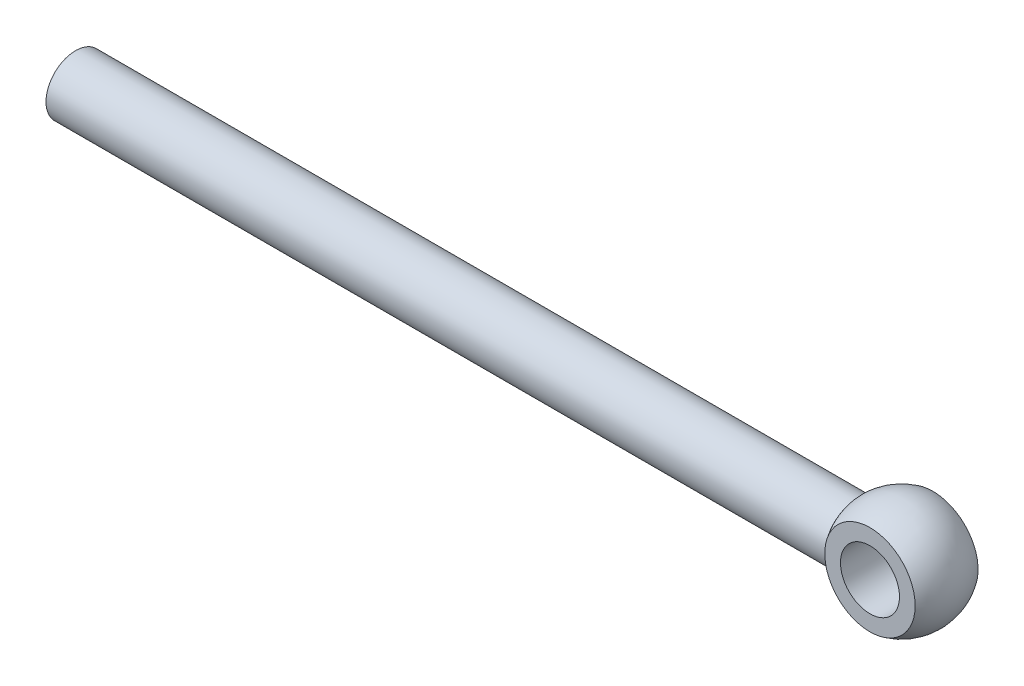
ISO-10303-21;
HEADER;
FILE_DESCRIPTION(('STEP AP214'),'2;1');
FILE_NAME('part.step','',(''),(''),'','','');
FILE_SCHEMA(('AUTOMOTIVE_DESIGN { 1 0 10303 214 1 1 1 1 }'));
ENDSEC;
DATA;
#1=APPLICATION_CONTEXT('core data for automotive mechanical design processes');
#2=APPLICATION_PROTOCOL_DEFINITION('international standard','automotive_design',2000,#1);
#3=PRODUCT_CONTEXT('',#1,'mechanical');
#4=PRODUCT('Part','Part','',(#3));
#5=PRODUCT_RELATED_PRODUCT_CATEGORY('part','',(#4));
#6=PRODUCT_DEFINITION_FORMATION('','',#4);
#7=PRODUCT_DEFINITION_CONTEXT('part definition',#1,'design');
#8=PRODUCT_DEFINITION('design','',#6,#7);
#9=PRODUCT_DEFINITION_SHAPE('','',#8);
#10=(LENGTH_UNIT() NAMED_UNIT(*) SI_UNIT(.MILLI.,.METRE.));
#11=(NAMED_UNIT(*) PLANE_ANGLE_UNIT() SI_UNIT($,.RADIAN.));
#12=(NAMED_UNIT(*) SI_UNIT($,.STERADIAN.) SOLID_ANGLE_UNIT());
#13=UNCERTAINTY_MEASURE_WITH_UNIT(LENGTH_MEASURE(1.E-05),#10,'distance_accuracy_value','');
#14=(GEOMETRIC_REPRESENTATION_CONTEXT(3) GLOBAL_UNCERTAINTY_ASSIGNED_CONTEXT((#13)) GLOBAL_UNIT_ASSIGNED_CONTEXT((#10,
#11,#12)) REPRESENTATION_CONTEXT('',''));
#15=CARTESIAN_POINT('',(0.,0.,0.));
#16=DIRECTION('',(0.,0.,1.));
#17=DIRECTION('',(1.,0.,0.));
#18=AXIS2_PLACEMENT_3D('',#15,#16,#17);
#19=CARTESIAN_POINT('',(1050.,0.,0.));
#20=DIRECTION('',(-1.,0.,0.));
#21=DIRECTION('',(0.,1.,0.));
#22=AXIS2_PLACEMENT_3D('',#19,#20,#21);
#23=SPHERICAL_SURFACE('',#22,70.0000000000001);
#24=CARTESIAN_POINT('',(1050.,0.,-40.));
#25=DIRECTION('',(0.,0.,-1.));
#26=DIRECTION('',(-1.,0.,0.));
#27=AXIS2_PLACEMENT_3D('',#24,#25,#26);
#28=CIRCLE('',#27,57.4456264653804);
#29=CARTESIAN_POINT('',(992.55437353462,0.,-40.));
#30=VERTEX_POINT('',#29);
#31=EDGE_CURVE('E36',#30,#30,#28,.T.);
#32=ORIENTED_EDGE('',*,*,#31,.F.);
#33=EDGE_LOOP('',(#32));
#34=FACE_BOUND('',#33,.T.);
#35=CARTESIAN_POINT('',(990.892047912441,0.,0.));
#36=DIRECTION('',(1.,0.,0.));
#37=DIRECTION('',(0.,0.,-1.));
#38=AXIS2_PLACEMENT_3D('',#35,#36,#37);
#39=CIRCLE('',#38,37.5);
#40=CARTESIAN_POINT('',(990.892047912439,0.,37.5));
#41=VERTEX_POINT('',#40);
#42=EDGE_CURVE('E74',#41,#41,#39,.F.);
#43=ORIENTED_EDGE('',*,*,#42,.F.);
#44=EDGE_LOOP('',(#43));
#45=FACE_BOUND('',#44,.T.);
#46=CARTESIAN_POINT('',(1120.,0.,0.));
#47=VERTEX_POINT('',#46);
#48=VERTEX_LOOP('',#47);
#49=FACE_BOUND('',#48,.T.);
#50=CARTESIAN_POINT('',(1050.,0.,40.));
#51=DIRECTION('',(0.,0.,1.));
#52=DIRECTION('',(1.,0.,0.));
#53=AXIS2_PLACEMENT_3D('',#50,#51,#52);
#54=CIRCLE('',#53,57.4456264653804);
#55=CARTESIAN_POINT('',(1107.44562646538,0.,40.));
#56=VERTEX_POINT('',#55);
#57=EDGE_CURVE('E11',#56,#56,#54,.T.);
#58=ORIENTED_EDGE('',*,*,#57,.F.);
#59=EDGE_LOOP('',(#58));
#60=FACE_BOUND('',#59,.T.);
#61=ADVANCED_FACE('F30',(#34,#45,#49,#60),#23,.T.);
#62=CARTESIAN_POINT('',(500000.,0.,0.));
#63=DIRECTION('',(-1.,0.,0.));
#64=DIRECTION('',(0.,0.,1.));
#65=AXIS2_PLACEMENT_3D('',#62,#63,#64);
#66=CYLINDRICAL_SURFACE('',#65,37.5);
#67=CARTESIAN_POINT('',(0.,0.,0.));
#68=DIRECTION('',(1.,0.,0.));
#69=DIRECTION('',(0.,0.,-1.));
#70=AXIS2_PLACEMENT_3D('',#67,#68,#69);
#71=CIRCLE('',#70,37.5);
#72=CARTESIAN_POINT('',(0.,0.,37.5));
#73=VERTEX_POINT('',#72);
#74=EDGE_CURVE('E71',#73,#73,#71,.T.);
#75=CARTESIAN_POINT('',(0.,0.,37.5));
#76=CARTESIAN_POINT('',(10.3217921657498,0.,37.5));
#77=CARTESIAN_POINT('',(20.6435843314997,0.,37.5));
#78=CARTESIAN_POINT('',(41.2871686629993,0.,37.5));
#79=CARTESIAN_POINT('',(51.6089608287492,0.,37.5));
#80=CARTESIAN_POINT('',(72.2525451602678,0.,37.5));
#81=CARTESIAN_POINT('',(82.5743373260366,0.,37.5));
#82=CARTESIAN_POINT('',(103.217921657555,0.,37.5));
#83=CARTESIAN_POINT('',(113.539713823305,0.,37.5));
#84=CARTESIAN_POINT('',(134.183298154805,0.,37.5));
#85=CARTESIAN_POINT('',(144.505090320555,0.,37.5));
#86=CARTESIAN_POINT('',(165.148674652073,0.,37.5));
#87=CARTESIAN_POINT('',(175.470466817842,0.,37.5));
#88=CARTESIAN_POINT('',(196.114051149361,0.,37.5));
#89=CARTESIAN_POINT('',(206.43584331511,0.,37.5));
#90=CARTESIAN_POINT('',(227.07942764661,0.,37.5));
#91=CARTESIAN_POINT('',(237.40121981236,0.,37.5));
#92=CARTESIAN_POINT('',(258.04480414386,0.,37.5));
#93=CARTESIAN_POINT('',(268.366596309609,0.,37.5));
#94=CARTESIAN_POINT('',(289.010180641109,0.,37.5));
#95=CARTESIAN_POINT('',(299.331972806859,0.,37.5));
#96=CARTESIAN_POINT('',(319.975557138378,0.,37.5));
#97=CARTESIAN_POINT('',(330.297349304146,0.,37.5));
#98=CARTESIAN_POINT('',(350.940933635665,0.,37.5));
#99=CARTESIAN_POINT('',(361.262725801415,0.,37.5));
#100=CARTESIAN_POINT('',(381.906310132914,0.,37.5));
#101=CARTESIAN_POINT('',(392.228102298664,0.,37.5));
#102=CARTESIAN_POINT('',(412.871686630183,0.,37.5));
#103=CARTESIAN_POINT('',(423.193478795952,0.,37.5));
#104=CARTESIAN_POINT('',(443.83706312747,0.,37.5));
#105=CARTESIAN_POINT('',(454.15885529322,0.,37.5));
#106=CARTESIAN_POINT('',(474.80243962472,0.,37.5));
#107=CARTESIAN_POINT('',(485.12423179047,0.,37.5));
#108=CARTESIAN_POINT('',(505.767816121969,0.,37.5));
#109=CARTESIAN_POINT('',(516.089608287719,0.,37.5));
#110=CARTESIAN_POINT('',(536.733192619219,0.,37.5));
#111=CARTESIAN_POINT('',(547.054984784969,0.,37.5));
#112=CARTESIAN_POINT('',(567.698569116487,0.,37.5));
#113=CARTESIAN_POINT('',(578.020361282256,0.,37.5));
#114=CARTESIAN_POINT('',(598.663945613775,0.,37.5));
#115=CARTESIAN_POINT('',(608.985737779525,0.,37.5));
#116=CARTESIAN_POINT('',(629.629322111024,0.,37.5));
#117=CARTESIAN_POINT('',(639.951114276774,0.,37.5));
#118=CARTESIAN_POINT('',(660.594698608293,0.,37.5));
#119=CARTESIAN_POINT('',(670.916490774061,0.,37.5));
#120=CARTESIAN_POINT('',(691.56007510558,0.,37.5));
#121=CARTESIAN_POINT('',(701.88186727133,0.,37.5));
#122=CARTESIAN_POINT('',(722.52545160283,0.,37.5));
#123=CARTESIAN_POINT('',(732.847243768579,0.,37.5));
#124=CARTESIAN_POINT('',(753.490828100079,0.,37.5));
#125=CARTESIAN_POINT('',(763.812620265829,0.,37.5));
#126=CARTESIAN_POINT('',(784.456204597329,0.,37.5));
#127=CARTESIAN_POINT('',(794.777996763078,0.,37.5));
#128=CARTESIAN_POINT('',(815.421581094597,0.,37.5));
#129=CARTESIAN_POINT('',(825.743373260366,0.,37.5));
#130=CARTESIAN_POINT('',(846.386957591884,0.,37.5));
#131=CARTESIAN_POINT('',(856.708749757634,0.,37.5));
#132=CARTESIAN_POINT('',(877.352334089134,0.,37.5));
#133=CARTESIAN_POINT('',(887.674126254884,0.,37.5));
#134=CARTESIAN_POINT('',(908.317710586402,0.,37.5));
#135=CARTESIAN_POINT('',(918.639502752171,0.,37.5));
#136=CARTESIAN_POINT('',(939.28308708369,0.,37.5));
#137=CARTESIAN_POINT('',(949.60487924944,0.,37.5));
#138=CARTESIAN_POINT('',(970.248463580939,0.,37.5));
#139=CARTESIAN_POINT('',(980.570255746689,0.,37.5));
#140=CARTESIAN_POINT('',(990.892047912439,0.,37.5));
#141=B_SPLINE_CURVE_WITH_KNOTS('',3,(#75,#76,#77,#78,#79,#80,#81,#82,#83,#84,#85,#86,#87,#88,
#89,#90,#91,#92,#93,#94,#95,#96,#97,#98,#99,#100,#101,#102,#103,#104,#105,#106,#107,#108,#109,
#110,#111,#112,#113,#114,#115,#116,#117,#118,#119,#120,#121,#122,#123,#124,#125,#126,#127,#128,
#129,#130,#131,#132,#133,#134,#135,#136,#137,#138,#139,#140),.UNSPECIFIED.,.F.,.F.,(4,2,2,2,2,2,
2,2,2,2,2,2,2,2,2,2,2,2,2,2,2,2,2,2,2,2,2,2,2,2,2,2,4),(0.,30.9653764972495,61.930752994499,
92.8961294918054,123.861505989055,154.826882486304,185.792258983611,216.75763548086,
247.72301197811,278.688388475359,309.653764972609,340.619141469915,371.584517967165,
402.549894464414,433.51527096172,464.48064745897,495.44602395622,526.411400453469,
557.376776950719,588.342153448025,619.307529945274,650.272906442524,681.23828293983,
712.20365943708,743.169035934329,774.134412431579,805.099788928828,836.065165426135,
867.030541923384,897.995918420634,928.96129491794,959.92667141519,990.892047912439),.UNSPECIFIED.);
#142=EDGE_CURVE('BSEAM41',#73,#41,#141,.T.);
#143=ORIENTED_EDGE('',*,*,#74,.T.);
#144=ORIENTED_EDGE('',*,*,#42,.T.);
#145=ORIENTED_EDGE('',*,*,#142,.T.);
#146=ORIENTED_EDGE('',*,*,#142,.F.);
#147=EDGE_LOOP('',(#143,#145,#144,#146));
#148=FACE_BOUND('',#147,.T.);
#149=ADVANCED_FACE('F41',(#148),#66,.T.);
#150=CARTESIAN_POINT('',(0.,0.,0.));
#151=DIRECTION('',(1.,0.,0.));
#152=DIRECTION('',(0.,0.,-1.));
#153=AXIS2_PLACEMENT_3D('',#150,#151,#152);
#154=PLANE('',#153);
#155=ORIENTED_EDGE('',*,*,#74,.F.);
#156=EDGE_LOOP('',(#155));
#157=FACE_BOUND('',#156,.T.);
#158=ADVANCED_FACE('F43',(#157),#154,.F.);
#159=CARTESIAN_POINT('',(980.,1421.70672081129,-40.));
#160=DIRECTION('',(0.,0.,-1.));
#161=DIRECTION('',(-1.,0.,0.));
#162=AXIS2_PLACEMENT_3D('',#159,#160,#161);
#163=PLANE('',#162);
#164=CARTESIAN_POINT('',(1050.,0.,-40.));
#165=DIRECTION('',(0.,0.,-1.));
#166=DIRECTION('',(-1.,0.,0.));
#167=AXIS2_PLACEMENT_3D('',#164,#165,#166);
#168=CIRCLE('',#167,37.5);
#169=CARTESIAN_POINT('',(1087.5,0.,-40.));
#170=VERTEX_POINT('',#169);
#171=EDGE_CURVE('E78',#170,#170,#168,.T.);
#172=ORIENTED_EDGE('',*,*,#171,.F.);
#173=EDGE_LOOP('',(#172));
#174=FACE_BOUND('',#173,.T.);
#175=ORIENTED_EDGE('',*,*,#31,.T.);
#176=EDGE_LOOP('',(#175));
#177=FACE_BOUND('',#176,.T.);
#178=ADVANCED_FACE('F49',(#174,#177),#163,.T.);
#179=CARTESIAN_POINT('',(980.,1421.70672081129,40.));
#180=DIRECTION('',(0.,0.,1.));
#181=DIRECTION('',(1.,0.,0.));
#182=AXIS2_PLACEMENT_3D('',#179,#180,#181);
#183=PLANE('',#182);
#184=CARTESIAN_POINT('',(1050.,0.,40.));
#185=DIRECTION('',(0.,0.,1.));
#186=DIRECTION('',(1.,0.,0.));
#187=AXIS2_PLACEMENT_3D('',#184,#185,#186);
#188=CIRCLE('',#187,37.5);
#189=CARTESIAN_POINT('',(1087.5,0.,40.));
#190=VERTEX_POINT('',#189);
#191=EDGE_CURVE('E83',#190,#190,#188,.T.);
#192=ORIENTED_EDGE('',*,*,#191,.F.);
#193=EDGE_LOOP('',(#192));
#194=FACE_BOUND('',#193,.T.);
#195=ORIENTED_EDGE('',*,*,#57,.T.);
#196=EDGE_LOOP('',(#195));
#197=FACE_BOUND('',#196,.T.);
#198=ADVANCED_FACE('F46',(#194,#197),#183,.T.);
#199=CARTESIAN_POINT('',(1050.,0.,-70.0000000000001));
#200=DIRECTION('',(0.,0.,1.));
#201=DIRECTION('',(1.,0.,0.));
#202=AXIS2_PLACEMENT_3D('',#199,#200,#201);
#203=CYLINDRICAL_SURFACE('',#202,37.5);
#204=CARTESIAN_POINT('',(1087.5,0.,-40.));
#205=CARTESIAN_POINT('',(1087.5,0.,-39.1666666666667));
#206=CARTESIAN_POINT('',(1087.5,0.,-38.3333333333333));
#207=CARTESIAN_POINT('',(1087.5,0.,-36.6666666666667));
#208=CARTESIAN_POINT('',(1087.5,0.,-35.8333333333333));
#209=CARTESIAN_POINT('',(1087.5,0.,-34.1666666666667));
#210=CARTESIAN_POINT('',(1087.5,0.,-33.3333333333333));
#211=CARTESIAN_POINT('',(1087.5,0.,-31.6666666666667));
#212=CARTESIAN_POINT('',(1087.5,0.,-30.8333333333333));
#213=CARTESIAN_POINT('',(1087.5,0.,-29.1666666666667));
#214=CARTESIAN_POINT('',(1087.5,0.,-28.3333333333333));
#215=CARTESIAN_POINT('',(1087.5,0.,-26.6666666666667));
#216=CARTESIAN_POINT('',(1087.5,0.,-25.8333333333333));
#217=CARTESIAN_POINT('',(1087.5,0.,-24.1666666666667));
#218=CARTESIAN_POINT('',(1087.5,0.,-23.3333333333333));
#219=CARTESIAN_POINT('',(1087.5,0.,-21.6666666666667));
#220=CARTESIAN_POINT('',(1087.5,0.,-20.8333333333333));
#221=CARTESIAN_POINT('',(1087.5,0.,-19.1666666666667));
#222=CARTESIAN_POINT('',(1087.5,0.,-18.3333333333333));
#223=CARTESIAN_POINT('',(1087.5,0.,-16.6666666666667));
#224=CARTESIAN_POINT('',(1087.5,0.,-15.8333333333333));
#225=CARTESIAN_POINT('',(1087.5,0.,-14.1666666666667));
#226=CARTESIAN_POINT('',(1087.5,0.,-13.3333333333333));
#227=CARTESIAN_POINT('',(1087.5,0.,-11.6666666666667));
#228=CARTESIAN_POINT('',(1087.5,0.,-10.8333333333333));
#229=CARTESIAN_POINT('',(1087.5,0.,-9.16666666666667));
#230=CARTESIAN_POINT('',(1087.5,0.,-8.33333333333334));
#231=CARTESIAN_POINT('',(1087.5,0.,-6.66666666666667));
#232=CARTESIAN_POINT('',(1087.5,0.,-5.83333333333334));
#233=CARTESIAN_POINT('',(1087.5,0.,-4.16666666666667));
#234=CARTESIAN_POINT('',(1087.5,0.,-3.33333333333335));
#235=CARTESIAN_POINT('',(1087.5,0.,-1.66666666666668));
#236=CARTESIAN_POINT('',(1087.5,0.,-0.833333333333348));
#237=CARTESIAN_POINT('',(1087.5,0.,0.83333333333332));
#238=CARTESIAN_POINT('',(1087.5,0.,1.66666666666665));
#239=CARTESIAN_POINT('',(1087.5,0.,3.33333333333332));
#240=CARTESIAN_POINT('',(1087.5,0.,4.16666666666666));
#241=CARTESIAN_POINT('',(1087.5,0.,5.83333333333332));
#242=CARTESIAN_POINT('',(1087.5,0.,6.66666666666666));
#243=CARTESIAN_POINT('',(1087.5,0.,8.33333333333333));
#244=CARTESIAN_POINT('',(1087.5,0.,9.16666666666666));
#245=CARTESIAN_POINT('',(1087.5,0.,10.8333333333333));
#246=CARTESIAN_POINT('',(1087.5,0.,11.6666666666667));
#247=CARTESIAN_POINT('',(1087.5,0.,13.3333333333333));
#248=CARTESIAN_POINT('',(1087.5,0.,14.1666666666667));
#249=CARTESIAN_POINT('',(1087.5,0.,15.8333333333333));
#250=CARTESIAN_POINT('',(1087.5,0.,16.6666666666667));
#251=CARTESIAN_POINT('',(1087.5,0.,18.3333333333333));
#252=CARTESIAN_POINT('',(1087.5,0.,19.1666666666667));
#253=CARTESIAN_POINT('',(1087.5,0.,20.8333333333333));
#254=CARTESIAN_POINT('',(1087.5,0.,21.6666666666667));
#255=CARTESIAN_POINT('',(1087.5,0.,23.3333333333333));
#256=CARTESIAN_POINT('',(1087.5,0.,24.1666666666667));
#257=CARTESIAN_POINT('',(1087.5,0.,25.8333333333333));
#258=CARTESIAN_POINT('',(1087.5,0.,26.6666666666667));
#259=CARTESIAN_POINT('',(1087.5,0.,28.3333333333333));
#260=CARTESIAN_POINT('',(1087.5,0.,29.1666666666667));
#261=CARTESIAN_POINT('',(1087.5,0.,30.8333333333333));
#262=CARTESIAN_POINT('',(1087.5,0.,31.6666666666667));
#263=CARTESIAN_POINT('',(1087.5,0.,33.3333333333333));
#264=CARTESIAN_POINT('',(1087.5,0.,34.1666666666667));
#265=CARTESIAN_POINT('',(1087.5,0.,35.8333333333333));
#266=CARTESIAN_POINT('',(1087.5,0.,36.6666666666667));
#267=CARTESIAN_POINT('',(1087.5,0.,38.3333333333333));
#268=CARTESIAN_POINT('',(1087.5,0.,39.1666666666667));
#269=CARTESIAN_POINT('',(1087.5,0.,40.));
#270=B_SPLINE_CURVE_WITH_KNOTS('',3,(#204,#205,#206,#207,#208,#209,#210,#211,#212,#213,#214,
#215,#216,#217,#218,#219,#220,#221,#222,#223,#224,#225,#226,#227,#228,#229,#230,#231,#232,#233,
#234,#235,#236,#237,#238,#239,#240,#241,#242,#243,#244,#245,#246,#247,#248,#249,#250,#251,#252,
#253,#254,#255,#256,#257,#258,#259,#260,#261,#262,#263,#264,#265,#266,#267,#268,#269),
.UNSPECIFIED.,.F.,.F.,(4,2,2,2,2,2,2,2,2,2,2,2,2,2,2,2,2,2,2,2,2,2,2,2,2,2,2,2,2,2,2,2,4),(0.,
2.5,4.99999999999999,7.49999999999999,9.99999999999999,12.5,15.,17.5,20.,22.5,25.,27.5,30.,32.5,
35.,37.5,40.,42.5,45.,47.5,50.,52.5,55.,57.5,60.,62.5,65.,67.5,70.,72.5,75.,77.5,80.),.UNSPECIFIED.);
#271=EDGE_CURVE('BSEAM48',#170,#190,#270,.T.);
#272=ORIENTED_EDGE('',*,*,#171,.T.);
#273=ORIENTED_EDGE('',*,*,#191,.T.);
#274=ORIENTED_EDGE('',*,*,#271,.T.);
#275=ORIENTED_EDGE('',*,*,#271,.F.);
#276=EDGE_LOOP('',(#272,#274,#273,#275));
#277=FACE_BOUND('',#276,.T.);
#278=ADVANCED_FACE('F48',(#277),#203,.F.);
#279=CLOSED_SHELL('',(#61,#149,#158,#178,#198,#278));
#280=MANIFOLD_SOLID_BREP('B2',#279);
#281=ADVANCED_BREP_SHAPE_REPRESENTATION('',(#18,#280),#14);
#282=SHAPE_DEFINITION_REPRESENTATION(#9,#281);
ENDSEC;
END-ISO-10303-21;
